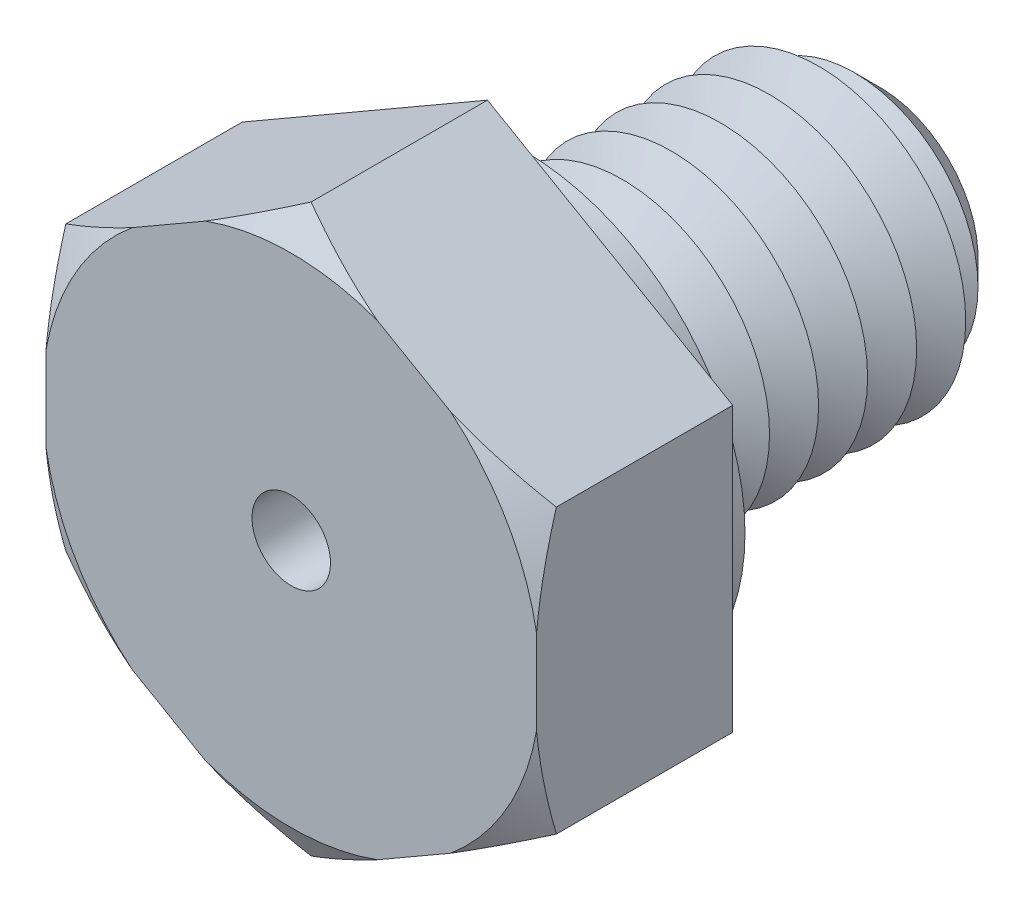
ISO-10303-21;
HEADER;
FILE_DESCRIPTION(('STEP AP214'),'2;1');
FILE_NAME('part.step','',(''),(''),'','','');
FILE_SCHEMA(('AUTOMOTIVE_DESIGN { 1 0 10303 214 1 1 1 1 }'));
ENDSEC;
DATA;
#1=APPLICATION_CONTEXT('core data for automotive mechanical design processes');
#2=APPLICATION_PROTOCOL_DEFINITION('international standard','automotive_design',2000,#1);
#3=PRODUCT_CONTEXT('',#1,'mechanical');
#4=PRODUCT('Part','Part','',(#3));
#5=PRODUCT_RELATED_PRODUCT_CATEGORY('part','',(#4));
#6=PRODUCT_DEFINITION_FORMATION('','',#4);
#7=PRODUCT_DEFINITION_CONTEXT('part definition',#1,'design');
#8=PRODUCT_DEFINITION('design','',#6,#7);
#9=PRODUCT_DEFINITION_SHAPE('','',#8);
#10=(LENGTH_UNIT() NAMED_UNIT(*) SI_UNIT(.MILLI.,.METRE.));
#11=(NAMED_UNIT(*) PLANE_ANGLE_UNIT() SI_UNIT($,.RADIAN.));
#12=(NAMED_UNIT(*) SI_UNIT($,.STERADIAN.) SOLID_ANGLE_UNIT());
#13=UNCERTAINTY_MEASURE_WITH_UNIT(LENGTH_MEASURE(1.E-05),#10,'distance_accuracy_value','');
#14=(GEOMETRIC_REPRESENTATION_CONTEXT(3) GLOBAL_UNCERTAINTY_ASSIGNED_CONTEXT((#13)) GLOBAL_UNIT_ASSIGNED_CONTEXT((#10,
#11,#12)) REPRESENTATION_CONTEXT('',''));
#15=CARTESIAN_POINT('',(0.,0.,0.));
#16=DIRECTION('',(0.,0.,1.));
#17=DIRECTION('',(1.,0.,0.));
#18=AXIS2_PLACEMENT_3D('',#15,#16,#17);
#19=CARTESIAN_POINT('',(5.,2.88675134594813,4.));
#20=DIRECTION('',(-0.5,-0.866025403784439,0.));
#21=DIRECTION('',(0.866025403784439,-0.5,0.));
#22=AXIS2_PLACEMENT_3D('',#19,#20,#21);
#23=PLANE('',#22);
#24=CARTESIAN_POINT('',(8.47277829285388,0.881741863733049,2.01100959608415));
#25=CARTESIAN_POINT('',(8.31567675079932,0.972444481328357,2.09578624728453));
#26=CARTESIAN_POINT('',(8.15819937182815,1.06336408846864,2.17964850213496));
#27=CARTESIAN_POINT('',(7.84233445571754,1.24572878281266,2.34511482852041));
#28=CARTESIAN_POINT('',(7.68394680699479,1.33717393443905,2.42671861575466));
#29=CARTESIAN_POINT('',(7.3656324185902,1.52095283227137,2.58747458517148));
#30=CARTESIAN_POINT('',(7.2057023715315,1.61328848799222,2.66661806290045));
#31=CARTESIAN_POINT('',(6.88464436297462,1.79865141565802,2.82158887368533));
#32=CARTESIAN_POINT('',(6.72351643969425,1.89167866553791,2.89741631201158));
#33=CARTESIAN_POINT('',(6.39574451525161,2.08091787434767,3.04691088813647));
#34=CARTESIAN_POINT('',(6.22906463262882,2.17715054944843,3.12047362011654));
#35=CARTESIAN_POINT('',(5.89404164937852,2.3705761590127,3.26235309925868));
#36=CARTESIAN_POINT('',(5.72569864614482,2.46776903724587,3.33067015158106));
#37=CARTESIAN_POINT('',(5.38728347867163,2.66315312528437,3.46077059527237));
#38=CARTESIAN_POINT('',(5.21721304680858,2.7613433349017,3.52255993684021));
#39=CARTESIAN_POINT('',(4.87507545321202,2.95887656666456,3.63817490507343));
#40=CARTESIAN_POINT('',(4.70300855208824,3.058219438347,3.69200155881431));
#41=CARTESIAN_POINT('',(4.29152467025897,3.29578976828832,3.8084273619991));
#42=CARTESIAN_POINT('',(4.05114917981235,3.43457062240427,3.86669526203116));
#43=CARTESIAN_POINT('',(3.68812002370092,3.64416560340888,3.93673911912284));
#44=CARTESIAN_POINT('',(3.56670137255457,3.71426669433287,3.95719387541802));
#45=CARTESIAN_POINT('',(3.32319777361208,3.85485356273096,3.99180309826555));
#46=CARTESIAN_POINT('',(3.20111291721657,3.92533928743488,4.0059584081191));
#47=CARTESIAN_POINT('',(2.95790980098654,4.06575267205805,4.0274398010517));
#48=CARTESIAN_POINT('',(2.83679666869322,4.13567737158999,4.03484289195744));
#49=CARTESIAN_POINT('',(2.59440145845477,4.27562431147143,4.04287861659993));
#50=CARTESIAN_POINT('',(2.47311938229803,4.34564655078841,4.0435113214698));
#51=CARTESIAN_POINT('',(2.23067249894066,4.48562332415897,4.03798617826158));
#52=CARTESIAN_POINT('',(2.10950769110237,4.55557785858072,4.03182836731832));
#53=CARTESIAN_POINT('',(1.86755304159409,4.695270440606,4.01290860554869));
#54=CARTESIAN_POINT('',(1.7467632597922,4.76500845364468,4.00014564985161));
#55=CARTESIAN_POINT('',(1.46148107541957,4.92971619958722,3.96252552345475));
#56=CARTESIAN_POINT('',(1.29725580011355,5.02453170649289,3.93494657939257));
#57=CARTESIAN_POINT('',(0.970375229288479,5.21325629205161,3.86938275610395));
#58=CARTESIAN_POINT('',(0.807720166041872,5.30716523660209,3.83139636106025));
#59=CARTESIAN_POINT('',(0.484000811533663,5.4940646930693,3.7464515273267));
#60=CARTESIAN_POINT('',(0.32293853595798,5.58705404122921,3.6994829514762));
#61=CARTESIAN_POINT('',(0.00262118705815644,5.77198934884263,3.59805355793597));
#62=CARTESIAN_POINT('',(-0.156634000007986,5.86393537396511,3.54359321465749));
#63=CARTESIAN_POINT('',(-0.475335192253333,6.04793759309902,3.42778810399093));
#64=CARTESIAN_POINT('',(-0.63476076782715,6.13998199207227,3.36636889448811));
#65=CARTESIAN_POINT('',(-0.951922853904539,6.3230956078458,3.2383676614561));
#66=CARTESIAN_POINT('',(-1.10966040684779,6.4141654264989,3.17178906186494));
#67=CARTESIAN_POINT('',(-1.42369760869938,6.59547488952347,3.03438397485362));
#68=CARTESIAN_POINT('',(-1.57999755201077,6.68571470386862,2.96355838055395));
#69=CARTESIAN_POINT('',(-1.89137153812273,6.86548655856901,2.81840247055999));
#70=CARTESIAN_POINT('',(-2.04644555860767,6.95501858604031,2.74407209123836));
#71=CARTESIAN_POINT('',(-2.30843737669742,7.1062796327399,2.61560341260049));
#72=CARTESIAN_POINT('',(-2.41563149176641,7.16816818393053,2.5622132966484));
#73=CARTESIAN_POINT('',(-2.62954890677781,7.29167346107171,2.45420118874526));
#74=CARTESIAN_POINT('',(-2.73627222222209,7.35329019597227,2.39957923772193));
#75=CARTESIAN_POINT('',(-2.94817046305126,7.4756297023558,2.28983212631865));
#76=CARTESIAN_POINT('',(-3.05334983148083,7.53635503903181,2.23471838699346));
#77=CARTESIAN_POINT('',(-3.26333506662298,7.65759007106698,2.12354428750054));
#78=CARTESIAN_POINT('',(-3.36814092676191,7.71809976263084,2.06748391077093));
#79=CARTESIAN_POINT('',(-3.47277829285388,7.77851217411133,2.01100959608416));
#80=B_SPLINE_CURVE_WITH_KNOTS('',3,(#24,#25,#26,#27,#28,#29,#30,#31,#32,#33,#34,#35,#36,#37,#38,
#39,#40,#41,#42,#43,#44,#45,#46,#47,#48,#49,#50,#51,#52,#53,#54,#55,#56,#57,#58,#59,#60,#61,#62,
#63,#64,#65,#66,#67,#68,#69,#70,#71,#72,#73,#74,#75,#76,#77,#78,#79),.UNSPECIFIED.,.F.,.F.,(4,2,
2,2,2,2,2,2,2,2,2,2,2,2,2,2,2,2,2,2,2,2,2,2,2,2,2,4),(0.,0.600718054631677,1.20151138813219,
1.80423204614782,2.40693355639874,3.02500509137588,3.64304064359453,4.26050788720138,
4.87789541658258,5.72780796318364,6.15275000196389,6.57763513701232,6.99761163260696,
7.41758371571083,7.83755350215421,8.25758719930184,8.83211758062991,9.40673168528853,
9.98199815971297,10.5572282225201,11.1393271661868,11.7210430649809,12.3026370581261,
12.8842416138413,13.2886376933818,13.6930203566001,14.0931288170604,14.493244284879),.UNSPECIFIED.);
#81=CARTESIAN_POINT('',(5.,2.88675134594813,3.59585481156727));
#82=VERTEX_POINT('',#81);
#83=CARTESIAN_POINT('',(3.24519941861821,3.89988593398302,4.));
#84=VERTEX_POINT('',#83);
#85=EDGE_CURVE('E132',#82,#84,#80,.T.);
#86=ORIENTED_EDGE('',*,*,#85,.F.);
#87=DIRECTION('',(0.,0.,-1.));
#88=VECTOR('',#87,1.);
#89=CARTESIAN_POINT('',(5.,2.88675134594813,4.));
#90=LINE('',#89,#88);
#91=CARTESIAN_POINT('',(5.,2.88675134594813,0.));
#92=VERTEX_POINT('',#91);
#93=EDGE_CURVE('E144',#82,#92,#90,.T.);
#94=ORIENTED_EDGE('',*,*,#93,.T.);
#95=DIRECTION('',(-0.866025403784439,0.5,0.));
#96=VECTOR('',#95,1.);
#97=CARTESIAN_POINT('',(5.,2.88675134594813,0.));
#98=LINE('',#97,#96);
#99=CARTESIAN_POINT('',(0.,5.77350269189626,0.));
#100=VERTEX_POINT('',#99);
#101=EDGE_CURVE('E259',#92,#100,#98,.T.);
#102=ORIENTED_EDGE('',*,*,#101,.T.);
#103=DIRECTION('',(0.,0.,-1.));
#104=VECTOR('',#103,1.);
#105=CARTESIAN_POINT('',(0.,5.77350269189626,4.));
#106=LINE('',#105,#104);
#107=CARTESIAN_POINT('',(0.,5.77350269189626,3.59585481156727));
#108=VERTEX_POINT('',#107);
#109=EDGE_CURVE('E179',#108,#100,#106,.T.);
#110=ORIENTED_EDGE('',*,*,#109,.F.);
#111=CARTESIAN_POINT('',(1.75480058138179,4.76036810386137,4.));
#112=VERTEX_POINT('',#111);
#113=EDGE_CURVE('E151',#112,#108,#80,.T.);
#114=ORIENTED_EDGE('',*,*,#113,.F.);
#115=DIRECTION('',(-0.866025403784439,0.5,0.));
#116=VECTOR('',#115,1.);
#117=CARTESIAN_POINT('',(5.,2.88675134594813,4.));
#118=LINE('',#117,#116);
#119=EDGE_CURVE('E148',#84,#112,#118,.T.);
#120=ORIENTED_EDGE('',*,*,#119,.F.);
#121=EDGE_LOOP('',(#86,#94,#102,#110,#114,#120));
#122=FACE_BOUND('',#121,.T.);
#123=ADVANCED_FACE('F39',(#122),#23,.F.);
#124=CARTESIAN_POINT('',(0.,5.77350269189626,4.));
#125=DIRECTION('',(0.5,-0.866025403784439,0.));
#126=DIRECTION('',(0.866025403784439,0.5,0.));
#127=AXIS2_PLACEMENT_3D('',#124,#125,#126);
#128=PLANE('',#127);
#129=CARTESIAN_POINT('',(3.47277829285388,7.77851217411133,2.01100959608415));
#130=CARTESIAN_POINT('',(3.31567675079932,7.68780955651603,2.09578624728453));
#131=CARTESIAN_POINT('',(3.15819937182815,7.59688994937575,2.17964850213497));
#132=CARTESIAN_POINT('',(2.84233445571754,7.41452525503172,2.34511482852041));
#133=CARTESIAN_POINT('',(2.68394680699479,7.32308010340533,2.42671861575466));
#134=CARTESIAN_POINT('',(2.36563241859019,7.13930120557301,2.58747458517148));
#135=CARTESIAN_POINT('',(2.2057023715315,7.04696554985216,2.66661806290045));
#136=CARTESIAN_POINT('',(1.88464436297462,6.86160262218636,2.82158887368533));
#137=CARTESIAN_POINT('',(1.72351643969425,6.76857537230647,2.89741631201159));
#138=CARTESIAN_POINT('',(1.39574451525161,6.57933616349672,3.04691088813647));
#139=CARTESIAN_POINT('',(1.22906463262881,6.48310348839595,3.12047362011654));
#140=CARTESIAN_POINT('',(0.894041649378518,6.28967787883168,3.26235309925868));
#141=CARTESIAN_POINT('',(0.725698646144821,6.19248500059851,3.33067015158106));
#142=CARTESIAN_POINT('',(0.38728347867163,5.99710091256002,3.46077059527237));
#143=CARTESIAN_POINT('',(0.217213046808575,5.89891070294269,3.52255993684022));
#144=CARTESIAN_POINT('',(-0.124924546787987,5.70137747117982,3.63817490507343));
#145=CARTESIAN_POINT('',(-0.296991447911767,5.60203459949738,3.69200155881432));
#146=CARTESIAN_POINT('',(-0.708475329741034,5.36446426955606,3.8084273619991));
#147=CARTESIAN_POINT('',(-0.948850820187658,5.22568341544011,3.86669526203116));
#148=CARTESIAN_POINT('',(-1.31187997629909,5.0160884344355,3.93673911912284));
#149=CARTESIAN_POINT('',(-1.43329862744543,4.94598734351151,3.95719387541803));
#150=CARTESIAN_POINT('',(-1.67680222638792,4.80540047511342,3.99180309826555));
#151=CARTESIAN_POINT('',(-1.79888708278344,4.7349147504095,4.0059584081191));
#152=CARTESIAN_POINT('',(-2.04209019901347,4.59450136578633,4.0274398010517));
#153=CARTESIAN_POINT('',(-2.16320333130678,4.52457666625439,4.03484289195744));
#154=CARTESIAN_POINT('',(-2.40559854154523,4.38462972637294,4.04287861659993));
#155=CARTESIAN_POINT('',(-2.52688061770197,4.31460748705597,4.04351132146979));
#156=CARTESIAN_POINT('',(-2.76932750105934,4.17463071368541,4.03798617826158));
#157=CARTESIAN_POINT('',(-2.89049230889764,4.10467617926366,4.03182836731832));
#158=CARTESIAN_POINT('',(-3.13244695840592,3.96498359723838,4.01290860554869));
#159=CARTESIAN_POINT('',(-3.25323674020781,3.8952455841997,4.00014564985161));
#160=CARTESIAN_POINT('',(-3.53851892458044,3.73053783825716,3.96252552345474));
#161=CARTESIAN_POINT('',(-3.70274419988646,3.63572233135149,3.93494657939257));
#162=CARTESIAN_POINT('',(-4.02962477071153,3.44699774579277,3.86938275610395));
#163=CARTESIAN_POINT('',(-4.19227983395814,3.35308880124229,3.83139636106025));
#164=CARTESIAN_POINT('',(-4.51599918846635,3.16618934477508,3.7464515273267));
#165=CARTESIAN_POINT('',(-4.67706146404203,3.07319999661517,3.6994829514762));
#166=CARTESIAN_POINT('',(-4.99737881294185,2.88826468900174,3.59805355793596));
#167=CARTESIAN_POINT('',(-5.156634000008,2.79631866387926,3.54359321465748));
#168=CARTESIAN_POINT('',(-5.47533519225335,2.61231644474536,3.42778810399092));
#169=CARTESIAN_POINT('',(-5.63476076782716,2.5202720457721,3.3663688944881));
#170=CARTESIAN_POINT('',(-5.95192285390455,2.33715842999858,3.23836766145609));
#171=CARTESIAN_POINT('',(-6.10966040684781,2.24608861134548,3.17178906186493));
#172=CARTESIAN_POINT('',(-6.4236976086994,2.0647791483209,3.03438397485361));
#173=CARTESIAN_POINT('',(-6.57999755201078,1.97453933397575,2.96355838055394));
#174=CARTESIAN_POINT('',(-6.89137153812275,1.79476747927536,2.81840247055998));
#175=CARTESIAN_POINT('',(-7.04644555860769,1.70523545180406,2.74407209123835));
#176=CARTESIAN_POINT('',(-7.30843737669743,1.55397440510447,2.61560341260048));
#177=CARTESIAN_POINT('',(-7.41563149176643,1.49208585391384,2.56221329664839));
#178=CARTESIAN_POINT('',(-7.62954890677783,1.36858057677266,2.45420118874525));
#179=CARTESIAN_POINT('',(-7.7362722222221,1.30696384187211,2.39957923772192));
#180=CARTESIAN_POINT('',(-7.94817046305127,1.18462433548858,2.28983212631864));
#181=CARTESIAN_POINT('',(-8.05334983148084,1.12389899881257,2.23471838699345));
#182=CARTESIAN_POINT('',(-8.26333506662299,1.0026639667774,2.12354428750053));
#183=CARTESIAN_POINT('',(-8.36814092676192,0.94215427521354,2.06748391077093));
#184=CARTESIAN_POINT('',(-8.47277829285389,0.881741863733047,2.01100959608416));
#185=B_SPLINE_CURVE_WITH_KNOTS('',3,(#129,#130,#131,#132,#133,#134,#135,#136,#137,#138,#139,
#140,#141,#142,#143,#144,#145,#146,#147,#148,#149,#150,#151,#152,#153,#154,#155,#156,#157,#158,
#159,#160,#161,#162,#163,#164,#165,#166,#167,#168,#169,#170,#171,#172,#173,#174,#175,#176,#177,
#178,#179,#180,#181,#182,#183,#184),.UNSPECIFIED.,.F.,.F.,(4,2,2,2,2,2,2,2,2,2,2,2,2,2,2,2,2,2,
2,2,2,2,2,2,2,2,2,4),(0.,0.600718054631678,1.20151138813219,1.80423204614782,2.40693355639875,
3.02500509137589,3.64304064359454,4.26050788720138,4.87789541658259,5.72780796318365,
6.1527500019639,6.57763513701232,6.99761163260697,7.41758371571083,7.83755350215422,
8.25758719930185,8.83211758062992,9.40673168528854,9.98199815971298,10.5572282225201,
11.1393271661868,11.7210430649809,12.3026370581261,12.8842416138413,13.2886376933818,
13.6930203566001,14.0931288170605,14.493244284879),.UNSPECIFIED.);
#186=CARTESIAN_POINT('',(-1.75480058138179,4.76036810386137,4.));
#187=VERTEX_POINT('',#186);
#188=EDGE_CURVE('E298',#108,#187,#185,.T.);
#189=ORIENTED_EDGE('',*,*,#188,.F.);
#190=ORIENTED_EDGE('',*,*,#109,.T.);
#191=DIRECTION('',(-0.866025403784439,-0.5,0.));
#192=VECTOR('',#191,1.);
#193=CARTESIAN_POINT('',(0.,5.77350269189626,0.));
#194=LINE('',#193,#192);
#195=CARTESIAN_POINT('',(-5.,2.88675134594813,0.));
#196=VERTEX_POINT('',#195);
#197=EDGE_CURVE('E278',#100,#196,#194,.T.);
#198=ORIENTED_EDGE('',*,*,#197,.T.);
#199=DIRECTION('',(0.,0.,-1.));
#200=VECTOR('',#199,1.);
#201=CARTESIAN_POINT('',(-5.,2.88675134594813,4.));
#202=LINE('',#201,#200);
#203=CARTESIAN_POINT('',(-5.,2.88675134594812,3.59585481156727));
#204=VERTEX_POINT('',#203);
#205=EDGE_CURVE('E176',#204,#196,#202,.T.);
#206=ORIENTED_EDGE('',*,*,#205,.F.);
#207=CARTESIAN_POINT('',(-3.24519941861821,3.89988593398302,4.));
#208=VERTEX_POINT('',#207);
#209=EDGE_CURVE('E299',#208,#204,#185,.T.);
#210=ORIENTED_EDGE('',*,*,#209,.F.);
#211=DIRECTION('',(-0.866025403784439,-0.5,0.));
#212=VECTOR('',#211,1.);
#213=CARTESIAN_POINT('',(0.,5.77350269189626,4.));
#214=LINE('',#213,#212);
#215=EDGE_CURVE('E262',#187,#208,#214,.T.);
#216=ORIENTED_EDGE('',*,*,#215,.F.);
#217=EDGE_LOOP('',(#189,#190,#198,#206,#210,#216));
#218=FACE_BOUND('',#217,.T.);
#219=ADVANCED_FACE('F371',(#218),#128,.F.);
#220=CARTESIAN_POINT('',(-5.,2.88675134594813,4.));
#221=DIRECTION('',(1.,0.,0.));
#222=DIRECTION('',(0.,0.,-1.));
#223=AXIS2_PLACEMENT_3D('',#220,#221,#222);
#224=PLANE('',#223);
#225=CARTESIAN_POINT('',(-5.,6.35952963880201,2.25858442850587));
#226=CARTESIAN_POINT('',(-5.,6.17888675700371,2.34055079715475));
#227=CARTESIAN_POINT('',(-5.,5.99774985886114,2.42144915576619));
#228=CARTESIAN_POINT('',(-5.,5.63427640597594,2.58059164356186));
#229=CARTESIAN_POINT('',(-5.,5.45193964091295,2.65883529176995));
#230=CARTESIAN_POINT('',(-5.,5.08515575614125,2.81244019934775));
#231=CARTESIAN_POINT('',(-5.,4.90070300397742,2.8877880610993));
#232=CARTESIAN_POINT('',(-5.,4.53023851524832,3.0345384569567));
#233=CARTESIAN_POINT('',(-5.,4.34422685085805,3.10594117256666));
#234=CARTESIAN_POINT('',(-5.,3.9712497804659,3.24361472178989));
#235=CARTESIAN_POINT('',(-5.,3.78429235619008,3.30990707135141));
#236=CARTESIAN_POINT('',(-5.,3.40837814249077,3.43663614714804));
#237=CARTESIAN_POINT('',(-5.,3.21942124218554,3.49707254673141));
#238=CARTESIAN_POINT('',(-5.,2.83960832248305,3.61070280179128));
#239=CARTESIAN_POINT('',(-5.,2.64875526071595,3.66390646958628));
#240=CARTESIAN_POINT('',(-5.,2.26482213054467,3.76165698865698));
#241=CARTESIAN_POINT('',(-5.,2.07174215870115,3.80620421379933));
#242=CARTESIAN_POINT('',(-5.,1.7384332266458,3.87385543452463));
#243=CARTESIAN_POINT('',(-5.,1.59871159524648,3.89946008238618));
#244=CARTESIAN_POINT('',(-5.,1.31833206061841,3.94478995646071));
#245=CARTESIAN_POINT('',(-5.,1.17767431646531,3.96451615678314));
#246=CARTESIAN_POINT('',(-5.,0.895629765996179,3.99757345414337));
#247=CARTESIAN_POINT('',(-5.,0.754243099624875,4.01090573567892));
#248=CARTESIAN_POINT('',(-5.,0.470989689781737,4.03079351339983));
#249=CARTESIAN_POINT('',(-5.,0.329122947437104,4.03734902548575));
#250=CARTESIAN_POINT('',(-5.,0.0453101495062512,4.04347876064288));
#251=CARTESIAN_POINT('',(-5.,-0.0966358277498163,4.04305657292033));
#252=CARTESIAN_POINT('',(-5.,-0.380333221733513,4.03525341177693));
#253=CARTESIAN_POINT('',(-5.,-0.522084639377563,4.02787247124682));
#254=CARTESIAN_POINT('',(-5.,-0.805078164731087,4.00637695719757));
#255=CARTESIAN_POINT('',(-5.,-0.946320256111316,3.99226216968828));
#256=CARTESIAN_POINT('',(-5.,-1.22803871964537,3.95770663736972));
#257=CARTESIAN_POINT('',(-5.,-1.36851494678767,3.93726473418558));
#258=CARTESIAN_POINT('',(-5.,-1.92842653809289,3.84388033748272));
#259=CARTESIAN_POINT('',(-5.,-2.34409397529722,3.74768165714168));
#260=CARTESIAN_POINT('',(-5.,-2.95991397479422,3.57615402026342));
#261=CARTESIAN_POINT('',(-5.,-3.16417440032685,3.51433916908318));
#262=CARTESIAN_POINT('',(-5.,-3.57033913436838,3.3833457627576));
#263=CARTESIAN_POINT('',(-5.,-3.77224360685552,3.31416772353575));
#264=CARTESIAN_POINT('',(-5.,-4.17620397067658,3.16907432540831));
#265=CARTESIAN_POINT('',(-5.,-4.37823505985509,3.09309081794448));
#266=CARTESIAN_POINT('',(-5.,-4.78041106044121,2.93626257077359));
#267=CARTESIAN_POINT('',(-5.,-4.98055585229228,2.85541752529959));
#268=CARTESIAN_POINT('',(-5.,-5.37797431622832,2.69033488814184));
#269=CARTESIAN_POINT('',(-5.,-5.57525810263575,2.60612151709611));
#270=CARTESIAN_POINT('',(-5.,-5.96839598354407,2.43454627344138));
#271=CARTESIAN_POINT('',(-5.,-6.16425041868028,2.34718518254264));
#272=CARTESIAN_POINT('',(-5.,-6.35952963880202,2.25858442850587));
#273=B_SPLINE_CURVE_WITH_KNOTS('',3,(#225,#226,#227,#228,#229,#230,#231,#232,#233,#234,#235,
#236,#237,#238,#239,#240,#241,#242,#243,#244,#245,#246,#247,#248,#249,#250,#251,#252,#253,#254,
#255,#256,#257,#258,#259,#260,#261,#262,#263,#264,#265,#266,#267,#268,#269,#270,#271,#272),
.UNSPECIFIED.,.F.,.F.,(4,2,2,2,2,2,2,2,2,2,2,2,2,2,2,2,2,2,2,2,2,2,2,4),(0.,0.595116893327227,
1.19034103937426,1.78805021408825,2.3857318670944,2.98074146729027,3.57578423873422,
4.17001151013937,4.7642131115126,5.19024951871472,5.61621528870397,6.0421021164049,
6.46798794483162,6.89365471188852,7.3193194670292,7.74499774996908,8.17075401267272,
9.44769357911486,10.0878733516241,10.7280082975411,11.3754821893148,12.0229968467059,
12.6664852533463,13.3098149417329),.UNSPECIFIED.);
#274=CARTESIAN_POINT('',(-5.,0.86048216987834,4.));
#275=VERTEX_POINT('',#274);
#276=EDGE_CURVE('E302',#204,#275,#273,.T.);
#277=ORIENTED_EDGE('',*,*,#276,.F.);
#278=ORIENTED_EDGE('',*,*,#205,.T.);
#279=DIRECTION('',(0.,-1.,0.));
#280=VECTOR('',#279,1.);
#281=CARTESIAN_POINT('',(-5.,2.88675134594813,0.));
#282=LINE('',#281,#280);
#283=CARTESIAN_POINT('',(-5.,-2.88675134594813,0.));
#284=VERTEX_POINT('',#283);
#285=EDGE_CURVE('E282',#196,#284,#282,.T.);
#286=ORIENTED_EDGE('',*,*,#285,.T.);
#287=DIRECTION('',(0.,0.,-1.));
#288=VECTOR('',#287,1.);
#289=CARTESIAN_POINT('',(-5.,-2.88675134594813,4.));
#290=LINE('',#289,#288);
#291=CARTESIAN_POINT('',(-4.99999999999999,-2.88675134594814,3.59585481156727));
#292=VERTEX_POINT('',#291);
#293=EDGE_CURVE('E173',#292,#284,#290,.T.);
#294=ORIENTED_EDGE('',*,*,#293,.F.);
#295=CARTESIAN_POINT('',(-5.,-0.86048216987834,4.));
#296=VERTEX_POINT('',#295);
#297=EDGE_CURVE('E308',#296,#292,#273,.T.);
#298=ORIENTED_EDGE('',*,*,#297,.F.);
#299=DIRECTION('',(0.,-1.,0.));
#300=VECTOR('',#299,1.);
#301=CARTESIAN_POINT('',(-5.,2.88675134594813,4.));
#302=LINE('',#301,#300);
#303=EDGE_CURVE('E266',#275,#296,#302,.T.);
#304=ORIENTED_EDGE('',*,*,#303,.F.);
#305=EDGE_LOOP('',(#277,#278,#286,#294,#298,#304));
#306=FACE_BOUND('',#305,.T.);
#307=ADVANCED_FACE('F330',(#306),#224,.F.);
#308=CARTESIAN_POINT('',(-5.,-2.88675134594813,4.));
#309=DIRECTION('',(0.5,0.866025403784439,0.));
#310=DIRECTION('',(-0.866025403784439,0.5,0.));
#311=AXIS2_PLACEMENT_3D('',#308,#309,#310);
#312=PLANE('',#311);
#313=CARTESIAN_POINT('',(-8.47277829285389,-0.881741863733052,2.01100959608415));
#314=CARTESIAN_POINT('',(-8.31567675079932,-0.972444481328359,2.09578624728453));
#315=CARTESIAN_POINT('',(-8.15819937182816,-1.06336408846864,2.17964850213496));
#316=CARTESIAN_POINT('',(-7.84233445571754,-1.24572878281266,2.34511482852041));
#317=CARTESIAN_POINT('',(-7.68394680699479,-1.33717393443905,2.42671861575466));
#318=CARTESIAN_POINT('',(-7.3656324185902,-1.52095283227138,2.58747458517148));
#319=CARTESIAN_POINT('',(-7.2057023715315,-1.61328848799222,2.66661806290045));
#320=CARTESIAN_POINT('',(-6.88464436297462,-1.79865141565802,2.82158887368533));
#321=CARTESIAN_POINT('',(-6.72351643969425,-1.89167866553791,2.89741631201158));
#322=CARTESIAN_POINT('',(-6.39574451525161,-2.08091787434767,3.04691088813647));
#323=CARTESIAN_POINT('',(-6.22906463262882,-2.17715054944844,3.12047362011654));
#324=CARTESIAN_POINT('',(-5.89404164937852,-2.37057615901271,3.26235309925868));
#325=CARTESIAN_POINT('',(-5.72569864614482,-2.46776903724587,3.33067015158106));
#326=CARTESIAN_POINT('',(-5.38728347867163,-2.66315312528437,3.46077059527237));
#327=CARTESIAN_POINT('',(-5.21721304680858,-2.7613433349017,3.52255993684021));
#328=CARTESIAN_POINT('',(-4.87507545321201,-2.95887656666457,3.63817490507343));
#329=CARTESIAN_POINT('',(-4.70300855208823,-3.05821943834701,3.69200155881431));
#330=CARTESIAN_POINT('',(-4.29152467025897,-3.29578976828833,3.8084273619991));
#331=CARTESIAN_POINT('',(-4.05114917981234,-3.43457062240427,3.86669526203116));
#332=CARTESIAN_POINT('',(-3.68812002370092,-3.64416560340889,3.93673911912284));
#333=CARTESIAN_POINT('',(-3.56670137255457,-3.71426669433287,3.95719387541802));
#334=CARTESIAN_POINT('',(-3.32319777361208,-3.85485356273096,3.99180309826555));
#335=CARTESIAN_POINT('',(-3.20111291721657,-3.92533928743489,4.0059584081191));
#336=CARTESIAN_POINT('',(-2.95790980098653,-4.06575267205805,4.0274398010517));
#337=CARTESIAN_POINT('',(-2.83679666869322,-4.13567737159,4.03484289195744));
#338=CARTESIAN_POINT('',(-2.59440145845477,-4.27562431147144,4.04287861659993));
#339=CARTESIAN_POINT('',(-2.47311938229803,-4.34564655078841,4.04351132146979));
#340=CARTESIAN_POINT('',(-2.23067249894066,-4.48562332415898,4.03798617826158));
#341=CARTESIAN_POINT('',(-2.10950769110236,-4.55557785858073,4.03182836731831));
#342=CARTESIAN_POINT('',(-1.86755304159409,-4.69527044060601,4.01290860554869));
#343=CARTESIAN_POINT('',(-1.74676325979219,-4.76500845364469,4.00014564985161));
#344=CARTESIAN_POINT('',(-1.46148107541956,-4.92971619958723,3.96252552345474));
#345=CARTESIAN_POINT('',(-1.29725580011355,-5.0245317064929,3.93494657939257));
#346=CARTESIAN_POINT('',(-0.970375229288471,-5.21325629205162,3.86938275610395));
#347=CARTESIAN_POINT('',(-0.807720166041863,-5.3071652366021,3.83139636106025));
#348=CARTESIAN_POINT('',(-0.484000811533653,-5.49406469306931,3.7464515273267));
#349=CARTESIAN_POINT('',(-0.322938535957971,-5.58705404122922,3.6994829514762));
#350=CARTESIAN_POINT('',(-0.00262118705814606,-5.77198934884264,3.59805355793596));
#351=CARTESIAN_POINT('',(0.156634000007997,-5.86393537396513,3.54359321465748));
#352=CARTESIAN_POINT('',(0.475335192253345,-6.04793759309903,3.42778810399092));
#353=CARTESIAN_POINT('',(0.634760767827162,-6.13998199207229,3.3663688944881));
#354=CARTESIAN_POINT('',(0.951922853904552,-6.32309560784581,3.23836766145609));
#355=CARTESIAN_POINT('',(1.10966040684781,-6.41416542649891,3.17178906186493));
#356=CARTESIAN_POINT('',(1.4236976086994,-6.59547488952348,3.03438397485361));
#357=CARTESIAN_POINT('',(1.57999755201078,-6.68571470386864,2.96355838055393));
#358=CARTESIAN_POINT('',(1.89137153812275,-6.86548655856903,2.81840247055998));
#359=CARTESIAN_POINT('',(2.04644555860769,-6.95501858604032,2.74407209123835));
#360=CARTESIAN_POINT('',(2.30843737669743,-7.10627963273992,2.61560341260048));
#361=CARTESIAN_POINT('',(2.41563149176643,-7.16816818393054,2.56221329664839));
#362=CARTESIAN_POINT('',(2.62954890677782,-7.29167346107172,2.45420118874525));
#363=CARTESIAN_POINT('',(2.73627222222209,-7.35329019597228,2.39957923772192));
#364=CARTESIAN_POINT('',(2.94817046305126,-7.47562970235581,2.28983212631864));
#365=CARTESIAN_POINT('',(3.05334983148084,-7.53635503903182,2.23471838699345));
#366=CARTESIAN_POINT('',(3.26333506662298,-7.65759007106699,2.12354428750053));
#367=CARTESIAN_POINT('',(3.36814092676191,-7.71809976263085,2.06748391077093));
#368=CARTESIAN_POINT('',(3.47277829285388,-7.77851217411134,2.01100959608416));
#369=B_SPLINE_CURVE_WITH_KNOTS('',3,(#313,#314,#315,#316,#317,#318,#319,#320,#321,#322,#323,
#324,#325,#326,#327,#328,#329,#330,#331,#332,#333,#334,#335,#336,#337,#338,#339,#340,#341,#342,
#343,#344,#345,#346,#347,#348,#349,#350,#351,#352,#353,#354,#355,#356,#357,#358,#359,#360,#361,
#362,#363,#364,#365,#366,#367,#368),.UNSPECIFIED.,.F.,.F.,(4,2,2,2,2,2,2,2,2,2,2,2,2,2,2,2,2,2,
2,2,2,2,2,2,2,2,2,4),(0.,0.600718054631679,1.20151138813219,1.80423204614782,2.40693355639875,
3.02500509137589,3.64304064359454,4.26050788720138,4.87789541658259,5.72780796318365,
6.1527500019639,6.57763513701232,6.99761163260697,7.41758371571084,7.83755350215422,
8.25758719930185,8.83211758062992,9.40673168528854,9.98199815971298,10.5572282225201,
11.1393271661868,11.7210430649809,12.3026370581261,12.8842416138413,13.2886376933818,
13.6930203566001,14.0931288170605,14.493244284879),.UNSPECIFIED.);
#370=CARTESIAN_POINT('',(-3.24519941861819,-3.89988593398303,4.));
#371=VERTEX_POINT('',#370);
#372=EDGE_CURVE('E309',#292,#371,#369,.T.);
#373=ORIENTED_EDGE('',*,*,#372,.F.);
#374=ORIENTED_EDGE('',*,*,#293,.T.);
#375=DIRECTION('',(0.866025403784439,-0.5,0.));
#376=VECTOR('',#375,1.);
#377=CARTESIAN_POINT('',(-5.,-2.88675134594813,0.));
#378=LINE('',#377,#376);
#379=CARTESIAN_POINT('',(0.,-5.77350269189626,0.));
#380=VERTEX_POINT('',#379);
#381=EDGE_CURVE('E286',#284,#380,#378,.T.);
#382=ORIENTED_EDGE('',*,*,#381,.T.);
#383=DIRECTION('',(0.,0.,-1.));
#384=VECTOR('',#383,1.);
#385=CARTESIAN_POINT('',(0.,-5.77350269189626,4.));
#386=LINE('',#385,#384);
#387=CARTESIAN_POINT('',(0.,-5.77350269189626,3.59585481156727));
#388=VERTEX_POINT('',#387);
#389=EDGE_CURVE('E163',#388,#380,#386,.T.);
#390=ORIENTED_EDGE('',*,*,#389,.F.);
#391=CARTESIAN_POINT('',(-1.75480058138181,-4.76036810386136,4.));
#392=VERTEX_POINT('',#391);
#393=EDGE_CURVE('E315',#392,#388,#369,.T.);
#394=ORIENTED_EDGE('',*,*,#393,.F.);
#395=DIRECTION('',(0.866025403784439,-0.5,0.));
#396=VECTOR('',#395,1.);
#397=CARTESIAN_POINT('',(-5.,-2.88675134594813,4.));
#398=LINE('',#397,#396);
#399=EDGE_CURVE('E270',#371,#392,#398,.T.);
#400=ORIENTED_EDGE('',*,*,#399,.F.);
#401=EDGE_LOOP('',(#373,#374,#382,#390,#394,#400));
#402=FACE_BOUND('',#401,.T.);
#403=ADVANCED_FACE('F362',(#402),#312,.F.);
#404=CARTESIAN_POINT('',(0.,-5.77350269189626,4.));
#405=DIRECTION('',(-0.5,0.866025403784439,0.));
#406=DIRECTION('',(-0.866025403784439,-0.5,0.));
#407=AXIS2_PLACEMENT_3D('',#404,#405,#406);
#408=PLANE('',#407);
#409=CARTESIAN_POINT('',(-3.47277829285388,-7.77851217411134,2.01100959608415));
#410=CARTESIAN_POINT('',(-3.31567675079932,-7.68780955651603,2.09578624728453));
#411=CARTESIAN_POINT('',(-3.15819937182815,-7.59688994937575,2.17964850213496));
#412=CARTESIAN_POINT('',(-2.84233445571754,-7.41452525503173,2.34511482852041));
#413=CARTESIAN_POINT('',(-2.68394680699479,-7.32308010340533,2.42671861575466));
#414=CARTESIAN_POINT('',(-2.36563241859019,-7.13930120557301,2.58747458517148));
#415=CARTESIAN_POINT('',(-2.2057023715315,-7.04696554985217,2.66661806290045));
#416=CARTESIAN_POINT('',(-1.88464436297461,-6.86160262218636,2.82158887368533));
#417=CARTESIAN_POINT('',(-1.72351643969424,-6.76857537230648,2.89741631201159));
#418=CARTESIAN_POINT('',(-1.39574451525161,-6.57933616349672,3.04691088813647));
#419=CARTESIAN_POINT('',(-1.22906463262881,-6.48310348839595,3.12047362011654));
#420=CARTESIAN_POINT('',(-0.894041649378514,-6.28967787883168,3.26235309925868));
#421=CARTESIAN_POINT('',(-0.725698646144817,-6.19248500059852,3.33067015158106));
#422=CARTESIAN_POINT('',(-0.387283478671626,-5.99710091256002,3.46077059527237));
#423=CARTESIAN_POINT('',(-0.217213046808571,-5.89891070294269,3.52255993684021));
#424=CARTESIAN_POINT('',(0.124924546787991,-5.70137747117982,3.63817490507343));
#425=CARTESIAN_POINT('',(0.296991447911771,-5.60203459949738,3.69200155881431));
#426=CARTESIAN_POINT('',(0.708475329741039,-5.36446426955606,3.8084273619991));
#427=CARTESIAN_POINT('',(0.948850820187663,-5.22568341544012,3.86669526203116));
#428=CARTESIAN_POINT('',(1.31187997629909,-5.0160884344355,3.93673911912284));
#429=CARTESIAN_POINT('',(1.43329862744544,-4.94598734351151,3.95719387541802));
#430=CARTESIAN_POINT('',(1.67680222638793,-4.80540047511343,3.99180309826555));
#431=CARTESIAN_POINT('',(1.79888708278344,-4.7349147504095,4.0059584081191));
#432=CARTESIAN_POINT('',(2.04209019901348,-4.59450136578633,4.0274398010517));
#433=CARTESIAN_POINT('',(2.16320333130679,-4.52457666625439,4.03484289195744));
#434=CARTESIAN_POINT('',(2.40559854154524,-4.38462972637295,4.04287861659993));
#435=CARTESIAN_POINT('',(2.52688061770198,-4.31460748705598,4.04351132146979));
#436=CARTESIAN_POINT('',(2.76932750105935,-4.17463071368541,4.03798617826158));
#437=CARTESIAN_POINT('',(2.89049230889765,-4.10467617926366,4.03182836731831));
#438=CARTESIAN_POINT('',(3.13244695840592,-3.96498359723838,4.01290860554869));
#439=CARTESIAN_POINT('',(3.25323674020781,-3.8952455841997,4.00014564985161));
#440=CARTESIAN_POINT('',(3.53851892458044,-3.73053783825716,3.96252552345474));
#441=CARTESIAN_POINT('',(3.70274419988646,-3.63572233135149,3.93494657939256));
#442=CARTESIAN_POINT('',(4.02962477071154,-3.44699774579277,3.86938275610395));
#443=CARTESIAN_POINT('',(4.19227983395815,-3.35308880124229,3.83139636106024));
#444=CARTESIAN_POINT('',(4.51599918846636,-3.16618934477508,3.7464515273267));
#445=CARTESIAN_POINT('',(4.67706146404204,-3.07319999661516,3.69948295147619));
#446=CARTESIAN_POINT('',(4.99737881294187,-2.88826468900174,3.59805355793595));
#447=CARTESIAN_POINT('',(5.15663400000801,-2.79631866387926,3.54359321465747));
#448=CARTESIAN_POINT('',(5.47533519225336,-2.61231644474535,3.42778810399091));
#449=CARTESIAN_POINT('',(5.63476076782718,-2.5202720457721,3.3663688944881));
#450=CARTESIAN_POINT('',(5.95192285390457,-2.33715842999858,3.23836766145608));
#451=CARTESIAN_POINT('',(6.10966040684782,-2.24608861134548,3.17178906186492));
#452=CARTESIAN_POINT('',(6.42369760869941,-2.0647791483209,3.0343839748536));
#453=CARTESIAN_POINT('',(6.5799975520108,-1.97453933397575,2.96355838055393));
#454=CARTESIAN_POINT('',(6.89137153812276,-1.79476747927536,2.81840247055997));
#455=CARTESIAN_POINT('',(7.04644555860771,-1.70523545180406,2.74407209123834));
#456=CARTESIAN_POINT('',(7.30843737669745,-1.55397440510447,2.61560341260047));
#457=CARTESIAN_POINT('',(7.41563149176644,-1.49208585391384,2.56221329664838));
#458=CARTESIAN_POINT('',(7.62954890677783,-1.36858057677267,2.45420118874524));
#459=CARTESIAN_POINT('',(7.7362722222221,-1.30696384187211,2.39957923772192));
#460=CARTESIAN_POINT('',(7.94817046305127,-1.18462433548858,2.28983212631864));
#461=CARTESIAN_POINT('',(8.05334983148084,-1.12389899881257,2.23471838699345));
#462=CARTESIAN_POINT('',(8.26333506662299,-1.00266396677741,2.12354428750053));
#463=CARTESIAN_POINT('',(8.36814092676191,-0.942154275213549,2.06748391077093));
#464=CARTESIAN_POINT('',(8.47277829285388,-0.881741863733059,2.01100959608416));
#465=B_SPLINE_CURVE_WITH_KNOTS('',3,(#409,#410,#411,#412,#413,#414,#415,#416,#417,#418,#419,
#420,#421,#422,#423,#424,#425,#426,#427,#428,#429,#430,#431,#432,#433,#434,#435,#436,#437,#438,
#439,#440,#441,#442,#443,#444,#445,#446,#447,#448,#449,#450,#451,#452,#453,#454,#455,#456,#457,
#458,#459,#460,#461,#462,#463,#464),.UNSPECIFIED.,.F.,.F.,(4,2,2,2,2,2,2,2,2,2,2,2,2,2,2,2,2,2,
2,2,2,2,2,2,2,2,2,4),(0.,0.600718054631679,1.20151138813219,1.80423204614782,2.40693355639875,
3.02500509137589,3.64304064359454,4.26050788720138,4.87789541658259,5.72780796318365,
6.1527500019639,6.57763513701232,6.99761163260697,7.41758371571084,7.83755350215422,
8.25758719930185,8.83211758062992,9.40673168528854,9.98199815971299,10.5572282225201,
11.1393271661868,11.7210430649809,12.3026370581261,12.8842416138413,13.2886376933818,
13.6930203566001,14.0931288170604,14.493244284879),.UNSPECIFIED.);
#466=CARTESIAN_POINT('',(1.75480058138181,-4.76036810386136,4.));
#467=VERTEX_POINT('',#466);
#468=EDGE_CURVE('E64',#388,#467,#465,.T.);
#469=ORIENTED_EDGE('',*,*,#468,.F.);
#470=ORIENTED_EDGE('',*,*,#389,.T.);
#471=DIRECTION('',(0.866025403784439,0.5,0.));
#472=VECTOR('',#471,1.);
#473=CARTESIAN_POINT('',(0.,-5.77350269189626,0.));
#474=LINE('',#473,#472);
#475=CARTESIAN_POINT('',(5.,-2.88675134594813,0.));
#476=VERTEX_POINT('',#475);
#477=EDGE_CURVE('E289',#380,#476,#474,.T.);
#478=ORIENTED_EDGE('',*,*,#477,.T.);
#479=DIRECTION('',(0.,0.,-1.));
#480=VECTOR('',#479,1.);
#481=CARTESIAN_POINT('',(5.,-2.88675134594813,4.));
#482=LINE('',#481,#480);
#483=CARTESIAN_POINT('',(5.,-2.88675134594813,3.59585481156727));
#484=VERTEX_POINT('',#483);
#485=EDGE_CURVE('E157',#484,#476,#482,.T.);
#486=ORIENTED_EDGE('',*,*,#485,.F.);
#487=CARTESIAN_POINT('',(3.24519941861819,-3.89988593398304,4.));
#488=VERTEX_POINT('',#487);
#489=EDGE_CURVE('E303',#488,#484,#465,.T.);
#490=ORIENTED_EDGE('',*,*,#489,.F.);
#491=DIRECTION('',(0.866025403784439,0.5,0.));
#492=VECTOR('',#491,1.);
#493=CARTESIAN_POINT('',(0.,-5.77350269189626,4.));
#494=LINE('',#493,#492);
#495=EDGE_CURVE('E166',#467,#488,#494,.T.);
#496=ORIENTED_EDGE('',*,*,#495,.F.);
#497=EDGE_LOOP('',(#469,#470,#478,#486,#490,#496));
#498=FACE_BOUND('',#497,.T.);
#499=ADVANCED_FACE('F359',(#498),#408,.F.);
#500=CARTESIAN_POINT('',(5.,-2.88675134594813,4.));
#501=DIRECTION('',(-1.,0.,0.));
#502=DIRECTION('',(0.,-1.,0.));
#503=AXIS2_PLACEMENT_3D('',#500,#501,#502);
#504=PLANE('',#503);
#505=CARTESIAN_POINT('',(5.,-6.35952963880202,2.25858442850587));
#506=CARTESIAN_POINT('',(5.,-6.17888675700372,2.34055079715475));
#507=CARTESIAN_POINT('',(5.,-5.99774985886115,2.42144915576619));
#508=CARTESIAN_POINT('',(5.,-5.63427640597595,2.58059164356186));
#509=CARTESIAN_POINT('',(5.,-5.45193964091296,2.65883529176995));
#510=CARTESIAN_POINT('',(5.,-5.08515575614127,2.81244019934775));
#511=CARTESIAN_POINT('',(5.,-4.90070300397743,2.8877880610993));
#512=CARTESIAN_POINT('',(5.,-4.53023851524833,3.0345384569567));
#513=CARTESIAN_POINT('',(5.,-4.34422685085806,3.10594117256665));
#514=CARTESIAN_POINT('',(5.,-3.97124978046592,3.24361472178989));
#515=CARTESIAN_POINT('',(5.,-3.78429235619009,3.3099070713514));
#516=CARTESIAN_POINT('',(5.,-3.40837814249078,3.43663614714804));
#517=CARTESIAN_POINT('',(5.,-3.21942124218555,3.4970725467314));
#518=CARTESIAN_POINT('',(5.,-2.83960832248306,3.61070280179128));
#519=CARTESIAN_POINT('',(5.,-2.64875526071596,3.66390646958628));
#520=CARTESIAN_POINT('',(5.,-2.26482213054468,3.76165698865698));
#521=CARTESIAN_POINT('',(5.,-2.07174215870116,3.80620421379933));
#522=CARTESIAN_POINT('',(5.,-1.7384332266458,3.87385543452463));
#523=CARTESIAN_POINT('',(5.,-1.59871159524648,3.89946008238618));
#524=CARTESIAN_POINT('',(5.,-1.31833206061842,3.94478995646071));
#525=CARTESIAN_POINT('',(5.,-1.17767431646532,3.96451615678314));
#526=CARTESIAN_POINT('',(5.,-0.895629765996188,3.99757345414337));
#527=CARTESIAN_POINT('',(5.,-0.754243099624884,4.01090573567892));
#528=CARTESIAN_POINT('',(5.,-0.470989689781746,4.03079351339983));
#529=CARTESIAN_POINT('',(5.,-0.329122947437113,4.03734902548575));
#530=CARTESIAN_POINT('',(5.,-0.0453101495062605,4.04347876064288));
#531=CARTESIAN_POINT('',(5.,0.0966358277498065,4.04305657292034));
#532=CARTESIAN_POINT('',(5.,0.380333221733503,4.03525341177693));
#533=CARTESIAN_POINT('',(5.,0.522084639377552,4.02787247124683));
#534=CARTESIAN_POINT('',(5.,0.805078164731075,4.00637695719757));
#535=CARTESIAN_POINT('',(5.,0.946320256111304,3.99226216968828));
#536=CARTESIAN_POINT('',(5.,1.22803871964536,3.95770663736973));
#537=CARTESIAN_POINT('',(5.,1.36851494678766,3.93726473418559));
#538=CARTESIAN_POINT('',(5.,1.92842653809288,3.84388033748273));
#539=CARTESIAN_POINT('',(5.,2.34409397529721,3.74768165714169));
#540=CARTESIAN_POINT('',(5.,2.95991397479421,3.57615402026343));
#541=CARTESIAN_POINT('',(5.,3.16417440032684,3.51433916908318));
#542=CARTESIAN_POINT('',(5.,3.57033913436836,3.3833457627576));
#543=CARTESIAN_POINT('',(5.,3.7722436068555,3.31416772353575));
#544=CARTESIAN_POINT('',(5.,4.17620397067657,3.16907432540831));
#545=CARTESIAN_POINT('',(5.,4.37823505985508,3.09309081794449));
#546=CARTESIAN_POINT('',(5.,4.7804110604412,2.9362625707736));
#547=CARTESIAN_POINT('',(5.,4.98055585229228,2.85541752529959));
#548=CARTESIAN_POINT('',(5.,5.37797431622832,2.69033488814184));
#549=CARTESIAN_POINT('',(5.,5.57525810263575,2.60612151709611));
#550=CARTESIAN_POINT('',(5.,5.96839598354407,2.43454627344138));
#551=CARTESIAN_POINT('',(5.,6.16425041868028,2.34718518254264));
#552=CARTESIAN_POINT('',(5.,6.35952963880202,2.25858442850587));
#553=B_SPLINE_CURVE_WITH_KNOTS('',3,(#505,#506,#507,#508,#509,#510,#511,#512,#513,#514,#515,
#516,#517,#518,#519,#520,#521,#522,#523,#524,#525,#526,#527,#528,#529,#530,#531,#532,#533,#534,
#535,#536,#537,#538,#539,#540,#541,#542,#543,#544,#545,#546,#547,#548,#549,#550,#551,#552),
.UNSPECIFIED.,.F.,.F.,(4,2,2,2,2,2,2,2,2,2,2,2,2,2,2,2,2,2,2,2,2,2,2,4),(0.,0.595116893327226,
1.19034103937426,1.78805021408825,2.3857318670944,2.98074146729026,3.57578423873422,
4.17001151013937,4.76421311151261,5.19024951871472,5.61621528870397,6.0421021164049,
6.46798794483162,6.89365471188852,7.3193194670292,7.74499774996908,8.17075401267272,
9.44769357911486,10.0878733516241,10.7280082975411,11.3754821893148,12.0229968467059,
12.6664852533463,13.3098149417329),.UNSPECIFIED.);
#554=CARTESIAN_POINT('',(5.,-0.860482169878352,4.));
#555=VERTEX_POINT('',#554);
#556=EDGE_CURVE('E56',#484,#555,#553,.T.);
#557=ORIENTED_EDGE('',*,*,#556,.F.);
#558=ORIENTED_EDGE('',*,*,#485,.T.);
#559=DIRECTION('',(0.,1.,0.));
#560=VECTOR('',#559,1.);
#561=CARTESIAN_POINT('',(5.,-2.88675134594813,0.));
#562=LINE('',#561,#560);
#563=EDGE_CURVE('E154',#476,#92,#562,.T.);
#564=ORIENTED_EDGE('',*,*,#563,.T.);
#565=ORIENTED_EDGE('',*,*,#93,.F.);
#566=CARTESIAN_POINT('',(5.,0.860482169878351,4.));
#567=VERTEX_POINT('',#566);
#568=EDGE_CURVE('E129',#567,#82,#553,.T.);
#569=ORIENTED_EDGE('',*,*,#568,.F.);
#570=DIRECTION('',(0.,1.,0.));
#571=VECTOR('',#570,1.);
#572=CARTESIAN_POINT('',(5.,-2.88675134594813,4.));
#573=LINE('',#572,#571);
#574=EDGE_CURVE('E158',#555,#567,#573,.T.);
#575=ORIENTED_EDGE('',*,*,#574,.F.);
#576=EDGE_LOOP('',(#557,#558,#564,#565,#569,#575));
#577=FACE_BOUND('',#576,.T.);
#578=ADVANCED_FACE('F152',(#577),#504,.F.);
#579=CARTESIAN_POINT('',(0.,0.,4.));
#580=DIRECTION('',(0.,0.,1.));
#581=DIRECTION('',(1.,0.,0.));
#582=AXIS2_PLACEMENT_3D('',#579,#580,#581);
#583=PLANE('',#582);
#584=CARTESIAN_POINT('',(0.,0.,4.));
#585=DIRECTION('',(0.,0.,1.));
#586=DIRECTION('',(1.,0.,0.));
#587=AXIS2_PLACEMENT_3D('',#584,#585,#586);
#588=CIRCLE('',#587,0.8);
#589=CARTESIAN_POINT('',(0.8,0.,4.));
#590=VERTEX_POINT('',#589);
#591=EDGE_CURVE('E410',#590,#590,#588,.T.);
#592=ORIENTED_EDGE('',*,*,#591,.F.);
#593=EDGE_LOOP('',(#592));
#594=FACE_BOUND('',#593,.T.);
#595=ORIENTED_EDGE('',*,*,#574,.T.);
#596=CARTESIAN_POINT('',(0.,0.,4.));
#597=DIRECTION('',(0.,0.,1.));
#598=DIRECTION('',(1.,0.,0.));
#599=AXIS2_PLACEMENT_3D('',#596,#597,#598);
#600=CIRCLE('',#599,5.07350269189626);
#601=EDGE_CURVE('E134',#567,#84,#600,.T.);
#602=ORIENTED_EDGE('',*,*,#601,.T.);
#603=ORIENTED_EDGE('',*,*,#119,.T.);
#604=CARTESIAN_POINT('',(0.,0.,4.));
#605=DIRECTION('',(0.,0.,1.));
#606=DIRECTION('',(1.,0.,0.));
#607=AXIS2_PLACEMENT_3D('',#604,#605,#606);
#608=CIRCLE('',#607,5.07350269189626);
#609=EDGE_CURVE('E11',#112,#187,#608,.T.);
#610=ORIENTED_EDGE('',*,*,#609,.T.);
#611=ORIENTED_EDGE('',*,*,#215,.T.);
#612=EDGE_CURVE('E49',#208,#275,#608,.T.);
#613=ORIENTED_EDGE('',*,*,#612,.T.);
#614=ORIENTED_EDGE('',*,*,#303,.T.);
#615=EDGE_CURVE('E307',#296,#371,#608,.T.);
#616=ORIENTED_EDGE('',*,*,#615,.T.);
#617=ORIENTED_EDGE('',*,*,#399,.T.);
#618=EDGE_CURVE('E306',#392,#467,#608,.T.);
#619=ORIENTED_EDGE('',*,*,#618,.T.);
#620=ORIENTED_EDGE('',*,*,#495,.T.);
#621=EDGE_CURVE('E43',#488,#555,#608,.T.);
#622=ORIENTED_EDGE('',*,*,#621,.T.);
#623=EDGE_LOOP('',(#595,#602,#603,#610,#611,#613,#614,#616,#617,#619,#620,#622));
#624=FACE_BOUND('',#623,.T.);
#625=ADVANCED_FACE('F398',(#594,#624),#583,.T.);
#626=CARTESIAN_POINT('',(0.,0.,0.));
#627=DIRECTION('',(0.,0.,1.));
#628=DIRECTION('',(1.,0.,0.));
#629=AXIS2_PLACEMENT_3D('',#626,#627,#628);
#630=PLANE('',#629);
#631=CARTESIAN_POINT('',(0.,0.,0.));
#632=DIRECTION('',(0.,0.,1.));
#633=DIRECTION('',(1.,0.,0.));
#634=AXIS2_PLACEMENT_3D('',#631,#632,#633);
#635=CIRCLE('',#634,4.5);
#636=CARTESIAN_POINT('',(4.5,0.,0.));
#637=VERTEX_POINT('',#636);
#638=EDGE_CURVE('E182',#637,#637,#635,.F.);
#639=ORIENTED_EDGE('',*,*,#638,.F.);
#640=EDGE_LOOP('',(#639));
#641=FACE_BOUND('',#640,.T.);
#642=ORIENTED_EDGE('',*,*,#101,.F.);
#643=ORIENTED_EDGE('',*,*,#563,.F.);
#644=ORIENTED_EDGE('',*,*,#477,.F.);
#645=ORIENTED_EDGE('',*,*,#381,.F.);
#646=ORIENTED_EDGE('',*,*,#285,.F.);
#647=ORIENTED_EDGE('',*,*,#197,.F.);
#648=EDGE_LOOP('',(#642,#643,#644,#645,#646,#647));
#649=FACE_BOUND('',#648,.T.);
#650=ADVANCED_FACE('F388',(#641,#649),#630,.F.);
#651=CARTESIAN_POINT('',(0.,0.,-0.75));
#652=DIRECTION('',(0.,0.,1.));
#653=DIRECTION('',(1.,0.,0.));
#654=AXIS2_PLACEMENT_3D('',#651,#652,#653);
#655=CYLINDRICAL_SURFACE('',#654,4.5);
#656=CARTESIAN_POINT('',(0.,0.,-0.75));
#657=DIRECTION('',(0.,0.,-1.));
#658=DIRECTION('',(-1.,0.,0.));
#659=AXIS2_PLACEMENT_3D('',#656,#657,#658);
#660=CIRCLE('',#659,4.5);
#661=CARTESIAN_POINT('',(-4.5,0.,-0.75));
#662=VERTEX_POINT('',#661);
#663=EDGE_CURVE('E255',#662,#662,#660,.T.);
#664=ORIENTED_EDGE('',*,*,#663,.F.);
#665=EDGE_LOOP('',(#664));
#666=FACE_BOUND('',#665,.T.);
#667=ORIENTED_EDGE('',*,*,#638,.T.);
#668=EDGE_LOOP('',(#667));
#669=FACE_BOUND('',#668,.T.);
#670=ADVANCED_FACE('F428',(#666,#669),#655,.T.);
#671=CARTESIAN_POINT('',(0.,0.,-0.75));
#672=DIRECTION('',(0.,0.,-1.));
#673=DIRECTION('',(-1.,0.,0.));
#674=AXIS2_PLACEMENT_3D('',#671,#672,#673);
#675=PLANE('',#674);
#676=CARTESIAN_POINT('',(0.,0.,-0.75));
#677=DIRECTION('',(0.,0.,1.));
#678=DIRECTION('',(1.,0.,0.));
#679=AXIS2_PLACEMENT_3D('',#676,#677,#678);
#680=CIRCLE('',#679,3.);
#681=CARTESIAN_POINT('',(3.,0.,-0.75));
#682=VERTEX_POINT('',#681);
#683=EDGE_CURVE('E251',#682,#682,#680,.T.);
#684=ORIENTED_EDGE('',*,*,#683,.T.);
#685=EDGE_LOOP('',(#684));
#686=FACE_BOUND('',#685,.T.);
#687=ORIENTED_EDGE('',*,*,#663,.T.);
#688=EDGE_LOOP('',(#687));
#689=FACE_BOUND('',#688,.T.);
#690=ADVANCED_FACE('F436',(#686,#689),#675,.T.);
#691=CARTESIAN_POINT('',(0.,0.,-0.75));
#692=DIRECTION('',(0.,0.,1.));
#693=DIRECTION('',(1.,0.,0.));
#694=AXIS2_PLACEMENT_3D('',#691,#692,#693);
#695=CONICAL_SURFACE('',#694,3.,1.0471975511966);
#696=CARTESIAN_POINT('',(0.,0.,-1.25));
#697=DIRECTION('',(0.,0.,1.));
#698=DIRECTION('',(1.,0.,0.));
#699=AXIS2_PLACEMENT_3D('',#696,#697,#698);
#700=CIRCLE('',#699,2.13397459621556);
#701=CARTESIAN_POINT('',(2.13397459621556,0.,-1.25));
#702=VERTEX_POINT('',#701);
#703=EDGE_CURVE('E247',#702,#702,#700,.T.);
#704=ORIENTED_EDGE('',*,*,#703,.T.);
#705=EDGE_LOOP('',(#704));
#706=FACE_BOUND('',#705,.T.);
#707=ORIENTED_EDGE('',*,*,#683,.F.);
#708=EDGE_LOOP('',(#707));
#709=FACE_BOUND('',#708,.T.);
#710=ADVANCED_FACE('F440',(#706,#709),#695,.T.);
#711=CARTESIAN_POINT('',(0.,0.,-1.25));
#712=DIRECTION('',(0.,0.,-1.));
#713=DIRECTION('',(-1.,0.,0.));
#714=AXIS2_PLACEMENT_3D('',#711,#712,#713);
#715=CONICAL_SURFACE('',#714,2.13397459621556,1.0471975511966);
#716=CARTESIAN_POINT('',(0.,0.,-1.75));
#717=DIRECTION('',(0.,0.,1.));
#718=DIRECTION('',(1.,0.,0.));
#719=AXIS2_PLACEMENT_3D('',#716,#717,#718);
#720=CIRCLE('',#719,3.);
#721=CARTESIAN_POINT('',(3.,0.,-1.75));
#722=VERTEX_POINT('',#721);
#723=EDGE_CURVE('E243',#722,#722,#720,.T.);
#724=ORIENTED_EDGE('',*,*,#723,.T.);
#725=EDGE_LOOP('',(#724));
#726=FACE_BOUND('',#725,.T.);
#727=ORIENTED_EDGE('',*,*,#703,.F.);
#728=EDGE_LOOP('',(#727));
#729=FACE_BOUND('',#728,.T.);
#730=ADVANCED_FACE('F444',(#726,#729),#715,.T.);
#731=CARTESIAN_POINT('',(0.,0.,-1.75));
#732=DIRECTION('',(0.,0.,1.));
#733=DIRECTION('',(1.,0.,0.));
#734=AXIS2_PLACEMENT_3D('',#731,#732,#733);
#735=CONICAL_SURFACE('',#734,3.,1.0471975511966);
#736=CARTESIAN_POINT('',(0.,0.,-2.25));
#737=DIRECTION('',(0.,0.,1.));
#738=DIRECTION('',(1.,0.,0.));
#739=AXIS2_PLACEMENT_3D('',#736,#737,#738);
#740=CIRCLE('',#739,2.13397459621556);
#741=CARTESIAN_POINT('',(2.13397459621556,0.,-2.25));
#742=VERTEX_POINT('',#741);
#743=EDGE_CURVE('E239',#742,#742,#740,.T.);
#744=ORIENTED_EDGE('',*,*,#743,.T.);
#745=EDGE_LOOP('',(#744));
#746=FACE_BOUND('',#745,.T.);
#747=ORIENTED_EDGE('',*,*,#723,.F.);
#748=EDGE_LOOP('',(#747));
#749=FACE_BOUND('',#748,.T.);
#750=ADVANCED_FACE('F448',(#746,#749),#735,.T.);
#751=CARTESIAN_POINT('',(0.,0.,-2.25));
#752=DIRECTION('',(0.,0.,-1.));
#753=DIRECTION('',(-1.,0.,0.));
#754=AXIS2_PLACEMENT_3D('',#751,#752,#753);
#755=CONICAL_SURFACE('',#754,2.13397459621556,1.0471975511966);
#756=CARTESIAN_POINT('',(0.,0.,-2.75));
#757=DIRECTION('',(0.,0.,1.));
#758=DIRECTION('',(1.,0.,0.));
#759=AXIS2_PLACEMENT_3D('',#756,#757,#758);
#760=CIRCLE('',#759,3.);
#761=CARTESIAN_POINT('',(3.,0.,-2.75));
#762=VERTEX_POINT('',#761);
#763=EDGE_CURVE('E235',#762,#762,#760,.T.);
#764=ORIENTED_EDGE('',*,*,#763,.T.);
#765=EDGE_LOOP('',(#764));
#766=FACE_BOUND('',#765,.T.);
#767=ORIENTED_EDGE('',*,*,#743,.F.);
#768=EDGE_LOOP('',(#767));
#769=FACE_BOUND('',#768,.T.);
#770=ADVANCED_FACE('F452',(#766,#769),#755,.T.);
#771=CARTESIAN_POINT('',(0.,0.,-2.75));
#772=DIRECTION('',(0.,0.,1.));
#773=DIRECTION('',(1.,0.,0.));
#774=AXIS2_PLACEMENT_3D('',#771,#772,#773);
#775=CONICAL_SURFACE('',#774,3.,1.0471975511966);
#776=CARTESIAN_POINT('',(0.,0.,-3.25));
#777=DIRECTION('',(0.,0.,1.));
#778=DIRECTION('',(1.,0.,0.));
#779=AXIS2_PLACEMENT_3D('',#776,#777,#778);
#780=CIRCLE('',#779,2.13397459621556);
#781=CARTESIAN_POINT('',(2.13397459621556,0.,-3.25));
#782=VERTEX_POINT('',#781);
#783=EDGE_CURVE('E231',#782,#782,#780,.T.);
#784=ORIENTED_EDGE('',*,*,#783,.T.);
#785=EDGE_LOOP('',(#784));
#786=FACE_BOUND('',#785,.T.);
#787=ORIENTED_EDGE('',*,*,#763,.F.);
#788=EDGE_LOOP('',(#787));
#789=FACE_BOUND('',#788,.T.);
#790=ADVANCED_FACE('F456',(#786,#789),#775,.T.);
#791=CARTESIAN_POINT('',(0.,0.,-3.25));
#792=DIRECTION('',(0.,0.,-1.));
#793=DIRECTION('',(-1.,0.,0.));
#794=AXIS2_PLACEMENT_3D('',#791,#792,#793);
#795=CONICAL_SURFACE('',#794,2.13397459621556,1.0471975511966);
#796=CARTESIAN_POINT('',(0.,0.,-3.75));
#797=DIRECTION('',(0.,0.,1.));
#798=DIRECTION('',(1.,0.,0.));
#799=AXIS2_PLACEMENT_3D('',#796,#797,#798);
#800=CIRCLE('',#799,3.);
#801=CARTESIAN_POINT('',(3.,0.,-3.75));
#802=VERTEX_POINT('',#801);
#803=EDGE_CURVE('E227',#802,#802,#800,.T.);
#804=ORIENTED_EDGE('',*,*,#803,.T.);
#805=EDGE_LOOP('',(#804));
#806=FACE_BOUND('',#805,.T.);
#807=ORIENTED_EDGE('',*,*,#783,.F.);
#808=EDGE_LOOP('',(#807));
#809=FACE_BOUND('',#808,.T.);
#810=ADVANCED_FACE('F460',(#806,#809),#795,.T.);
#811=CARTESIAN_POINT('',(0.,0.,-3.75));
#812=DIRECTION('',(0.,0.,1.));
#813=DIRECTION('',(1.,0.,0.));
#814=AXIS2_PLACEMENT_3D('',#811,#812,#813);
#815=CONICAL_SURFACE('',#814,3.,1.0471975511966);
#816=CARTESIAN_POINT('',(0.,0.,-4.25));
#817=DIRECTION('',(0.,0.,1.));
#818=DIRECTION('',(1.,0.,0.));
#819=AXIS2_PLACEMENT_3D('',#816,#817,#818);
#820=CIRCLE('',#819,2.13397459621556);
#821=CARTESIAN_POINT('',(2.13397459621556,0.,-4.25));
#822=VERTEX_POINT('',#821);
#823=EDGE_CURVE('E223',#822,#822,#820,.T.);
#824=ORIENTED_EDGE('',*,*,#823,.T.);
#825=EDGE_LOOP('',(#824));
#826=FACE_BOUND('',#825,.T.);
#827=ORIENTED_EDGE('',*,*,#803,.F.);
#828=EDGE_LOOP('',(#827));
#829=FACE_BOUND('',#828,.T.);
#830=ADVANCED_FACE('F464',(#826,#829),#815,.T.);
#831=CARTESIAN_POINT('',(0.,0.,-4.25));
#832=DIRECTION('',(0.,0.,-1.));
#833=DIRECTION('',(-1.,0.,0.));
#834=AXIS2_PLACEMENT_3D('',#831,#832,#833);
#835=CONICAL_SURFACE('',#834,2.13397459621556,1.0471975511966);
#836=CARTESIAN_POINT('',(0.,0.,-4.75));
#837=DIRECTION('',(0.,0.,1.));
#838=DIRECTION('',(1.,0.,0.));
#839=AXIS2_PLACEMENT_3D('',#836,#837,#838);
#840=CIRCLE('',#839,3.);
#841=CARTESIAN_POINT('',(3.,0.,-4.75));
#842=VERTEX_POINT('',#841);
#843=EDGE_CURVE('E220',#842,#842,#840,.T.);
#844=ORIENTED_EDGE('',*,*,#843,.T.);
#845=EDGE_LOOP('',(#844));
#846=FACE_BOUND('',#845,.T.);
#847=ORIENTED_EDGE('',*,*,#823,.F.);
#848=EDGE_LOOP('',(#847));
#849=FACE_BOUND('',#848,.T.);
#850=ADVANCED_FACE('F468',(#846,#849),#835,.T.);
#851=CARTESIAN_POINT('',(0.,0.,-4.75));
#852=DIRECTION('',(0.,0.,1.));
#853=DIRECTION('',(1.,0.,0.));
#854=AXIS2_PLACEMENT_3D('',#851,#852,#853);
#855=CONICAL_SURFACE('',#854,3.,1.0471975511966);
#856=CARTESIAN_POINT('',(0.,0.,-5.25));
#857=DIRECTION('',(0.,0.,1.));
#858=DIRECTION('',(1.,0.,0.));
#859=AXIS2_PLACEMENT_3D('',#856,#857,#858);
#860=CIRCLE('',#859,2.13397459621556);
#861=CARTESIAN_POINT('',(2.13397459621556,0.,-5.25));
#862=VERTEX_POINT('',#861);
#863=EDGE_CURVE('E217',#862,#862,#860,.T.);
#864=ORIENTED_EDGE('',*,*,#863,.T.);
#865=EDGE_LOOP('',(#864));
#866=FACE_BOUND('',#865,.T.);
#867=ORIENTED_EDGE('',*,*,#843,.F.);
#868=EDGE_LOOP('',(#867));
#869=FACE_BOUND('',#868,.T.);
#870=ADVANCED_FACE('F472',(#866,#869),#855,.T.);
#871=CARTESIAN_POINT('',(0.,0.,-5.25));
#872=DIRECTION('',(0.,0.,-1.));
#873=DIRECTION('',(-1.,0.,0.));
#874=AXIS2_PLACEMENT_3D('',#871,#872,#873);
#875=CONICAL_SURFACE('',#874,2.13397459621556,1.0471975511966);
#876=CARTESIAN_POINT('',(0.,0.,-5.75));
#877=DIRECTION('',(0.,0.,1.));
#878=DIRECTION('',(1.,0.,0.));
#879=AXIS2_PLACEMENT_3D('',#876,#877,#878);
#880=CIRCLE('',#879,3.);
#881=CARTESIAN_POINT('',(3.,0.,-5.75));
#882=VERTEX_POINT('',#881);
#883=EDGE_CURVE('E200',#882,#882,#880,.T.);
#884=ORIENTED_EDGE('',*,*,#883,.T.);
#885=EDGE_LOOP('',(#884));
#886=FACE_BOUND('',#885,.T.);
#887=ORIENTED_EDGE('',*,*,#863,.F.);
#888=EDGE_LOOP('',(#887));
#889=FACE_BOUND('',#888,.T.);
#890=ADVANCED_FACE('F476',(#886,#889),#875,.T.);
#891=CARTESIAN_POINT('',(0.,0.,-5.75));
#892=DIRECTION('',(0.,0.,1.));
#893=DIRECTION('',(1.,0.,0.));
#894=AXIS2_PLACEMENT_3D('',#891,#892,#893);
#895=CONICAL_SURFACE('',#894,3.,1.0471975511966);
#896=CARTESIAN_POINT('',(0.,0.,-6.25));
#897=DIRECTION('',(0.,0.,1.));
#898=DIRECTION('',(1.,0.,0.));
#899=AXIS2_PLACEMENT_3D('',#896,#897,#898);
#900=CIRCLE('',#899,2.13397459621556);
#901=CARTESIAN_POINT('',(2.13397459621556,0.,-6.25));
#902=VERTEX_POINT('',#901);
#903=EDGE_CURVE('E192',#902,#902,#900,.T.);
#904=ORIENTED_EDGE('',*,*,#903,.T.);
#905=EDGE_LOOP('',(#904));
#906=FACE_BOUND('',#905,.T.);
#907=ORIENTED_EDGE('',*,*,#883,.F.);
#908=EDGE_LOOP('',(#907));
#909=FACE_BOUND('',#908,.T.);
#910=ADVANCED_FACE('F480',(#906,#909),#895,.T.);
#911=CARTESIAN_POINT('',(0.,0.,-6.25));
#912=DIRECTION('',(0.,0.,-1.));
#913=DIRECTION('',(-1.,0.,0.));
#914=AXIS2_PLACEMENT_3D('',#911,#912,#913);
#915=CONICAL_SURFACE('',#914,2.13397459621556,1.0471975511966);
#916=CARTESIAN_POINT('',(0.,0.,-6.75));
#917=DIRECTION('',(0.,0.,1.));
#918=DIRECTION('',(1.,0.,0.));
#919=AXIS2_PLACEMENT_3D('',#916,#917,#918);
#920=CIRCLE('',#919,3.);
#921=CARTESIAN_POINT('',(3.,0.,-6.75));
#922=VERTEX_POINT('',#921);
#923=EDGE_CURVE('E193',#922,#922,#920,.T.);
#924=ORIENTED_EDGE('',*,*,#923,.T.);
#925=EDGE_LOOP('',(#924));
#926=FACE_BOUND('',#925,.T.);
#927=ORIENTED_EDGE('',*,*,#903,.F.);
#928=EDGE_LOOP('',(#927));
#929=FACE_BOUND('',#928,.T.);
#930=ADVANCED_FACE('F484',(#926,#929),#915,.T.);
#931=CARTESIAN_POINT('',(0.,0.,-6.75));
#932=DIRECTION('',(0.,0.,1.));
#933=DIRECTION('',(1.,0.,0.));
#934=AXIS2_PLACEMENT_3D('',#931,#932,#933);
#935=CONICAL_SURFACE('',#934,3.,1.0471975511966);
#936=CARTESIAN_POINT('',(0.,0.,-7.25));
#937=DIRECTION('',(0.,0.,1.));
#938=DIRECTION('',(1.,0.,0.));
#939=AXIS2_PLACEMENT_3D('',#936,#937,#938);
#940=CIRCLE('',#939,2.13397459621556);
#941=CARTESIAN_POINT('',(2.13397459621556,0.,-7.25));
#942=VERTEX_POINT('',#941);
#943=EDGE_CURVE('E204',#942,#942,#940,.T.);
#944=ORIENTED_EDGE('',*,*,#943,.T.);
#945=EDGE_LOOP('',(#944));
#946=FACE_BOUND('',#945,.T.);
#947=ORIENTED_EDGE('',*,*,#923,.F.);
#948=EDGE_LOOP('',(#947));
#949=FACE_BOUND('',#948,.T.);
#950=ADVANCED_FACE('F487',(#946,#949),#935,.T.);
#951=CARTESIAN_POINT('',(0.,0.,-7.25));
#952=DIRECTION('',(0.,0.,-1.));
#953=DIRECTION('',(-1.,0.,0.));
#954=AXIS2_PLACEMENT_3D('',#951,#952,#953);
#955=CONICAL_SURFACE('',#954,2.13397459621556,1.0471975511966);
#956=CARTESIAN_POINT('',(0.,0.,-7.47548094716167));
#957=DIRECTION('',(0.,0.,-1.));
#958=DIRECTION('',(-1.,0.,0.));
#959=AXIS2_PLACEMENT_3D('',#956,#957,#958);
#960=CIRCLE('',#959,2.52451905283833);
#961=CARTESIAN_POINT('',(-2.52451905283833,0.,-7.47548094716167));
#962=VERTEX_POINT('',#961);
#963=EDGE_CURVE('E189',#962,#962,#960,.T.);
#964=ORIENTED_EDGE('',*,*,#963,.F.);
#965=EDGE_LOOP('',(#964));
#966=FACE_BOUND('',#965,.T.);
#967=ORIENTED_EDGE('',*,*,#943,.F.);
#968=EDGE_LOOP('',(#967));
#969=FACE_BOUND('',#968,.T.);
#970=ADVANCED_FACE('F340',(#966,#969),#955,.T.);
#971=CARTESIAN_POINT('',(0.,0.,-8.));
#972=DIRECTION('',(0.,0.,-1.));
#973=DIRECTION('',(-1.,0.,0.));
#974=AXIS2_PLACEMENT_3D('',#971,#972,#973);
#975=PLANE('',#974);
#976=CARTESIAN_POINT('',(0.,0.,-8.));
#977=DIRECTION('',(0.,0.,-1.));
#978=DIRECTION('',(-1.,0.,0.));
#979=AXIS2_PLACEMENT_3D('',#976,#977,#978);
#980=CIRCLE('',#979,0.8);
#981=CARTESIAN_POINT('',(0.8,0.,-8.));
#982=VERTEX_POINT('',#981);
#983=EDGE_CURVE('E408',#982,#982,#980,.F.);
#984=ORIENTED_EDGE('',*,*,#983,.T.);
#985=EDGE_LOOP('',(#984));
#986=FACE_BOUND('',#985,.T.);
#987=CARTESIAN_POINT('',(0.,0.,-8.));
#988=DIRECTION('',(0.,0.,-1.));
#989=DIRECTION('',(-1.,0.,0.));
#990=AXIS2_PLACEMENT_3D('',#987,#988,#989);
#991=CIRCLE('',#990,2.);
#992=CARTESIAN_POINT('',(-2.,0.,-8.));
#993=VERTEX_POINT('',#992);
#994=EDGE_CURVE('E186',#993,#993,#991,.T.);
#995=ORIENTED_EDGE('',*,*,#994,.T.);
#996=EDGE_LOOP('',(#995));
#997=FACE_BOUND('',#996,.T.);
#998=ADVANCED_FACE('F431',(#986,#997),#975,.T.);
#999=CARTESIAN_POINT('',(0.,0.,-8.));
#1000=DIRECTION('',(0.,0.,1.));
#1001=DIRECTION('',(1.,0.,0.));
#1002=AXIS2_PLACEMENT_3D('',#999,#1000,#1001);
#1003=CONICAL_SURFACE('',#1002,2.,0.785398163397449);
#1004=ORIENTED_EDGE('',*,*,#994,.F.);
#1005=EDGE_LOOP('',(#1004));
#1006=FACE_BOUND('',#1005,.T.);
#1007=ORIENTED_EDGE('',*,*,#963,.T.);
#1008=EDGE_LOOP('',(#1007));
#1009=FACE_BOUND('',#1008,.T.);
#1010=ADVANCED_FACE('F41',(#1006,#1009),#1003,.T.);
#1011=CARTESIAN_POINT('',(0.,0.,4.));
#1012=DIRECTION('',(0.,0.,-1.));
#1013=DIRECTION('',(-1.,0.,0.));
#1014=AXIS2_PLACEMENT_3D('',#1011,#1012,#1013);
#1015=CONICAL_SURFACE('',#1014,5.07350269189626,1.0471975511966);
#1016=ORIENTED_EDGE('',*,*,#489,.T.);
#1017=ORIENTED_EDGE('',*,*,#556,.T.);
#1018=ORIENTED_EDGE('',*,*,#621,.F.);
#1019=EDGE_LOOP('',(#1016,#1017,#1018));
#1020=FACE_BOUND('',#1019,.T.);
#1021=ADVANCED_FACE('F507',(#1020),#1015,.T.);
#1022=ORIENTED_EDGE('',*,*,#393,.T.);
#1023=ORIENTED_EDGE('',*,*,#468,.T.);
#1024=ORIENTED_EDGE('',*,*,#618,.F.);
#1025=EDGE_LOOP('',(#1022,#1023,#1024));
#1026=FACE_BOUND('',#1025,.T.);
#1027=ADVANCED_FACE('F513',(#1026),#1015,.T.);
#1028=ORIENTED_EDGE('',*,*,#297,.T.);
#1029=ORIENTED_EDGE('',*,*,#372,.T.);
#1030=ORIENTED_EDGE('',*,*,#615,.F.);
#1031=EDGE_LOOP('',(#1028,#1029,#1030));
#1032=FACE_BOUND('',#1031,.T.);
#1033=ADVANCED_FACE('F518',(#1032),#1015,.T.);
#1034=ORIENTED_EDGE('',*,*,#209,.T.);
#1035=ORIENTED_EDGE('',*,*,#276,.T.);
#1036=ORIENTED_EDGE('',*,*,#612,.F.);
#1037=EDGE_LOOP('',(#1034,#1035,#1036));
#1038=FACE_BOUND('',#1037,.T.);
#1039=ADVANCED_FACE('F337',(#1038),#1015,.T.);
#1040=ORIENTED_EDGE('',*,*,#113,.T.);
#1041=ORIENTED_EDGE('',*,*,#188,.T.);
#1042=ORIENTED_EDGE('',*,*,#609,.F.);
#1043=EDGE_LOOP('',(#1040,#1041,#1042));
#1044=FACE_BOUND('',#1043,.T.);
#1045=ADVANCED_FACE('F332',(#1044),#1015,.T.);
#1046=ORIENTED_EDGE('',*,*,#85,.T.);
#1047=ORIENTED_EDGE('',*,*,#601,.F.);
#1048=ORIENTED_EDGE('',*,*,#568,.T.);
#1049=EDGE_LOOP('',(#1046,#1047,#1048));
#1050=FACE_BOUND('',#1049,.T.);
#1051=ADVANCED_FACE('F131',(#1050),#1015,.T.);
#1052=CARTESIAN_POINT('',(0.,0.,-10.262741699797));
#1053=DIRECTION('',(0.,0.,1.));
#1054=DIRECTION('',(1.,0.,0.));
#1055=AXIS2_PLACEMENT_3D('',#1052,#1053,#1054);
#1056=CYLINDRICAL_SURFACE('',#1055,0.8);
#1057=CARTESIAN_POINT('',(0.8,0.,4.));
#1058=CARTESIAN_POINT('',(0.8,0.,3.875));
#1059=CARTESIAN_POINT('',(0.8,0.,3.75));
#1060=CARTESIAN_POINT('',(0.8,0.,3.5));
#1061=CARTESIAN_POINT('',(0.8,0.,3.375));
#1062=CARTESIAN_POINT('',(0.8,0.,3.125));
#1063=CARTESIAN_POINT('',(0.8,0.,3.));
#1064=CARTESIAN_POINT('',(0.8,0.,2.75));
#1065=CARTESIAN_POINT('',(0.8,0.,2.625));
#1066=CARTESIAN_POINT('',(0.8,0.,2.375));
#1067=CARTESIAN_POINT('',(0.8,0.,2.25));
#1068=CARTESIAN_POINT('',(0.8,0.,2.));
#1069=CARTESIAN_POINT('',(0.8,0.,1.875));
#1070=CARTESIAN_POINT('',(0.8,0.,1.625));
#1071=CARTESIAN_POINT('',(0.8,0.,1.5));
#1072=CARTESIAN_POINT('',(0.8,0.,1.25));
#1073=CARTESIAN_POINT('',(0.8,0.,1.125));
#1074=CARTESIAN_POINT('',(0.8,0.,0.874999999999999));
#1075=CARTESIAN_POINT('',(0.8,0.,0.749999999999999));
#1076=CARTESIAN_POINT('',(0.8,0.,0.499999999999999));
#1077=CARTESIAN_POINT('',(0.8,0.,0.374999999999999));
#1078=CARTESIAN_POINT('',(0.8,0.,0.124999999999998));
#1079=CARTESIAN_POINT('',(0.8,0.,0.));
#1080=CARTESIAN_POINT('',(0.8,0.,-0.250000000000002));
#1081=CARTESIAN_POINT('',(0.8,0.,-0.375000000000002));
#1082=CARTESIAN_POINT('',(0.8,0.,-0.625000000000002));
#1083=CARTESIAN_POINT('',(0.8,0.,-0.750000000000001));
#1084=CARTESIAN_POINT('',(0.8,0.,-1.));
#1085=CARTESIAN_POINT('',(0.8,0.,-1.125));
#1086=CARTESIAN_POINT('',(0.8,0.,-1.375));
#1087=CARTESIAN_POINT('',(0.8,0.,-1.5));
#1088=CARTESIAN_POINT('',(0.8,0.,-1.75));
#1089=CARTESIAN_POINT('',(0.8,0.,-1.875));
#1090=CARTESIAN_POINT('',(0.8,0.,-2.125));
#1091=CARTESIAN_POINT('',(0.8,0.,-2.25));
#1092=CARTESIAN_POINT('',(0.8,0.,-2.5));
#1093=CARTESIAN_POINT('',(0.8,0.,-2.625));
#1094=CARTESIAN_POINT('',(0.8,0.,-2.875));
#1095=CARTESIAN_POINT('',(0.8,0.,-3.));
#1096=CARTESIAN_POINT('',(0.8,0.,-3.25));
#1097=CARTESIAN_POINT('',(0.8,0.,-3.375));
#1098=CARTESIAN_POINT('',(0.8,0.,-3.625));
#1099=CARTESIAN_POINT('',(0.8,0.,-3.75));
#1100=CARTESIAN_POINT('',(0.8,0.,-4.));
#1101=CARTESIAN_POINT('',(0.8,0.,-4.125));
#1102=CARTESIAN_POINT('',(0.8,0.,-4.375));
#1103=CARTESIAN_POINT('',(0.8,0.,-4.5));
#1104=CARTESIAN_POINT('',(0.8,0.,-4.75));
#1105=CARTESIAN_POINT('',(0.8,0.,-4.875));
#1106=CARTESIAN_POINT('',(0.8,0.,-5.125));
#1107=CARTESIAN_POINT('',(0.8,0.,-5.25));
#1108=CARTESIAN_POINT('',(0.8,0.,-5.5));
#1109=CARTESIAN_POINT('',(0.8,0.,-5.625));
#1110=CARTESIAN_POINT('',(0.8,0.,-5.875));
#1111=CARTESIAN_POINT('',(0.8,0.,-6.));
#1112=CARTESIAN_POINT('',(0.8,0.,-6.25));
#1113=CARTESIAN_POINT('',(0.8,0.,-6.375));
#1114=CARTESIAN_POINT('',(0.8,0.,-6.625));
#1115=CARTESIAN_POINT('',(0.8,0.,-6.75));
#1116=CARTESIAN_POINT('',(0.8,0.,-7.));
#1117=CARTESIAN_POINT('',(0.8,0.,-7.125));
#1118=CARTESIAN_POINT('',(0.8,0.,-7.375));
#1119=CARTESIAN_POINT('',(0.8,0.,-7.5));
#1120=CARTESIAN_POINT('',(0.8,0.,-7.75));
#1121=CARTESIAN_POINT('',(0.8,0.,-7.875));
#1122=CARTESIAN_POINT('',(0.8,0.,-8.));
#1123=B_SPLINE_CURVE_WITH_KNOTS('',3,(#1057,#1058,#1059,#1060,#1061,#1062,#1063,#1064,#1065,
#1066,#1067,#1068,#1069,#1070,#1071,#1072,#1073,#1074,#1075,#1076,#1077,#1078,#1079,#1080,#1081,
#1082,#1083,#1084,#1085,#1086,#1087,#1088,#1089,#1090,#1091,#1092,#1093,#1094,#1095,#1096,#1097,
#1098,#1099,#1100,#1101,#1102,#1103,#1104,#1105,#1106,#1107,#1108,#1109,#1110,#1111,#1112,#1113,
#1114,#1115,#1116,#1117,#1118,#1119,#1120,#1121,#1122),.UNSPECIFIED.,.F.,.F.,(4,2,2,2,2,2,2,2,2,
2,2,2,2,2,2,2,2,2,2,2,2,2,2,2,2,2,2,2,2,2,2,2,4),(0.,0.375,0.750000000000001,1.125,1.5,1.875,
2.25,2.625,3.,3.375,3.75,4.125,4.5,4.875,5.25,5.625,6.,6.375,6.75,7.125,7.5,7.875,8.25,8.625,9.,
9.375,9.75,10.125,10.5,10.875,11.25,11.625,12.),.UNSPECIFIED.);
#1124=EDGE_CURVE('BSEAM339',#590,#982,#1123,.T.);
#1125=ORIENTED_EDGE('',*,*,#591,.T.);
#1126=ORIENTED_EDGE('',*,*,#983,.F.);
#1127=ORIENTED_EDGE('',*,*,#1124,.T.);
#1128=ORIENTED_EDGE('',*,*,#1124,.F.);
#1129=EDGE_LOOP('',(#1125,#1127,#1126,#1128));
#1130=FACE_BOUND('',#1129,.T.);
#1131=ADVANCED_FACE('F339',(#1130),#1056,.F.);
#1132=CLOSED_SHELL('',(#123,#219,#307,#403,#499,#578,#625,#650,#670,#690,#710,#730,#750,#770,
#790,#810,#830,#850,#870,#890,#910,#930,#950,#970,#998,#1010,#1021,#1027,#1033,#1039,#1045,
#1051,#1131));
#1133=MANIFOLD_SOLID_BREP('B2',#1132);
#1134=ADVANCED_BREP_SHAPE_REPRESENTATION('',(#18,#1133),#14);
#1135=SHAPE_DEFINITION_REPRESENTATION(#9,#1134);
ENDSEC;
END-ISO-10303-21;
